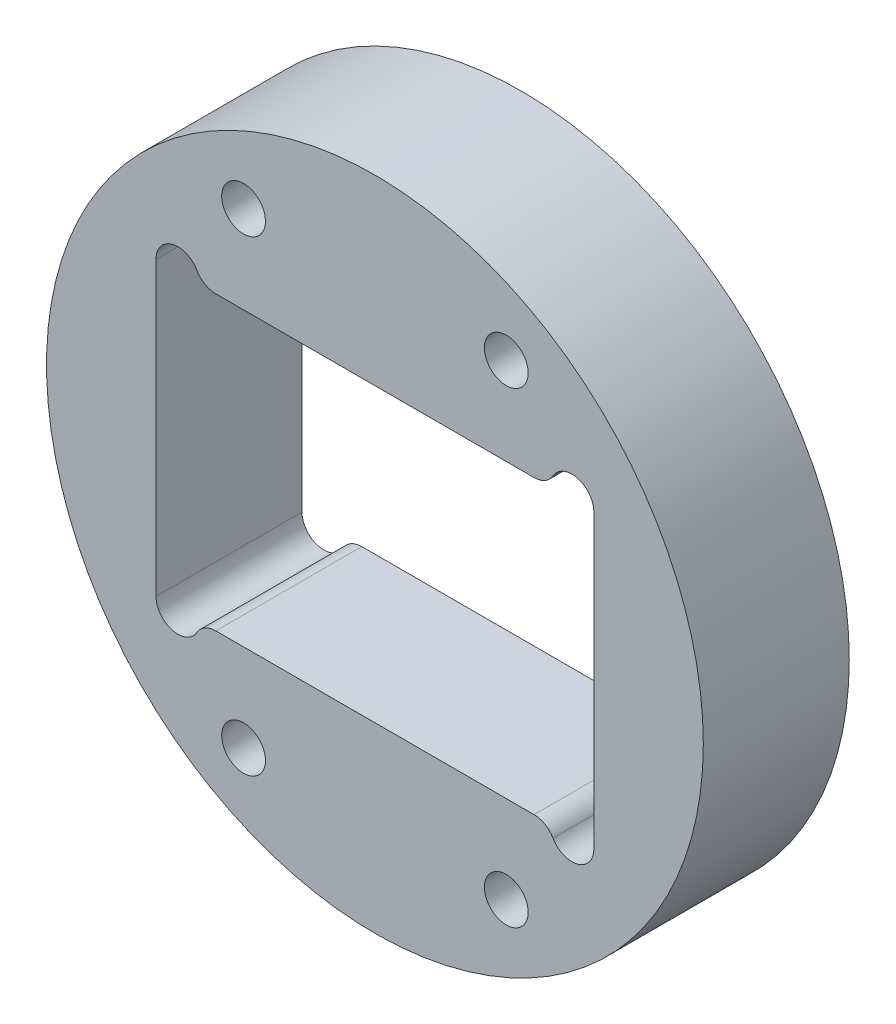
ISO-10303-21;
HEADER;
FILE_DESCRIPTION(('STEP AP214'),'2;1');
FILE_NAME('part.step','',(''),(''),'','','');
FILE_SCHEMA(('AUTOMOTIVE_DESIGN { 1 0 10303 214 1 1 1 1 }'));
ENDSEC;
DATA;
#1=APPLICATION_CONTEXT('core data for automotive mechanical design processes');
#2=APPLICATION_PROTOCOL_DEFINITION('international standard','automotive_design',2000,#1);
#3=PRODUCT_CONTEXT('',#1,'mechanical');
#4=PRODUCT('Part','Part','',(#3));
#5=PRODUCT_RELATED_PRODUCT_CATEGORY('part','',(#4));
#6=PRODUCT_DEFINITION_FORMATION('','',#4);
#7=PRODUCT_DEFINITION_CONTEXT('part definition',#1,'design');
#8=PRODUCT_DEFINITION('design','',#6,#7);
#9=PRODUCT_DEFINITION_SHAPE('','',#8);
#10=(LENGTH_UNIT() NAMED_UNIT(*) SI_UNIT(.MILLI.,.METRE.));
#11=(NAMED_UNIT(*) PLANE_ANGLE_UNIT() SI_UNIT($,.RADIAN.));
#12=(NAMED_UNIT(*) SI_UNIT($,.STERADIAN.) SOLID_ANGLE_UNIT());
#13=UNCERTAINTY_MEASURE_WITH_UNIT(LENGTH_MEASURE(1.E-05),#10,'distance_accuracy_value','');
#14=(GEOMETRIC_REPRESENTATION_CONTEXT(3) GLOBAL_UNCERTAINTY_ASSIGNED_CONTEXT((#13)) GLOBAL_UNIT_ASSIGNED_CONTEXT((#10,
#11,#12)) REPRESENTATION_CONTEXT('',''));
#15=CARTESIAN_POINT('',(0.,0.,0.));
#16=DIRECTION('',(0.,0.,1.));
#17=DIRECTION('',(1.,0.,0.));
#18=AXIS2_PLACEMENT_3D('',#15,#16,#17);
#19=CARTESIAN_POINT('',(-62.0464763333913,20.0201457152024,10.));
#20=DIRECTION('',(0.,0.,1.));
#21=DIRECTION('',(1.,0.,0.));
#22=AXIS2_PLACEMENT_3D('',#19,#20,#21);
#23=PLANE('',#22);
#24=CARTESIAN_POINT('',(-53.0464763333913,4.02014571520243,10.));
#25=DIRECTION('',(0.,0.,1.));
#26=DIRECTION('',(1.,0.,0.));
#27=AXIS2_PLACEMENT_3D('',#24,#25,#26);
#28=CIRCLE('',#27,1.5);
#29=CARTESIAN_POINT('',(-51.5464763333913,4.02014571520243,10.));
#30=VERTEX_POINT('',#29);
#31=EDGE_CURVE('E425',#30,#30,#28,.T.);
#32=ORIENTED_EDGE('',*,*,#31,.F.);
#33=EDGE_LOOP('',(#32));
#34=FACE_BOUND('',#33,.T.);
#35=CARTESIAN_POINT('',(-71.0464763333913,36.0201457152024,10.));
#36=DIRECTION('',(0.,0.,1.));
#37=DIRECTION('',(1.,0.,0.));
#38=AXIS2_PLACEMENT_3D('',#35,#36,#37);
#39=CIRCLE('',#38,1.5);
#40=CARTESIAN_POINT('',(-69.5464763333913,36.0201457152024,10.));
#41=VERTEX_POINT('',#40);
#42=EDGE_CURVE('E177',#41,#41,#39,.T.);
#43=ORIENTED_EDGE('',*,*,#42,.F.);
#44=EDGE_LOOP('',(#43));
#45=FACE_BOUND('',#44,.T.);
#46=CARTESIAN_POINT('',(-62.0464763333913,20.0201457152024,10.));
#47=DIRECTION('',(0.,0.,1.));
#48=DIRECTION('',(1.,0.,0.));
#49=AXIS2_PLACEMENT_3D('',#46,#47,#48);
#50=CIRCLE('',#49,22.5);
#51=CARTESIAN_POINT('',(-39.5464763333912,20.0201457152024,10.));
#52=VERTEX_POINT('',#51);
#53=EDGE_CURVE('E11',#52,#52,#50,.T.);
#54=ORIENTED_EDGE('',*,*,#53,.T.);
#55=EDGE_LOOP('',(#54));
#56=FACE_BOUND('',#55,.T.);
#57=DIRECTION('',(-1.,0.,0.));
#58=VECTOR('',#57,1.);
#59=CARTESIAN_POINT('',(-72.948400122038,30.0201457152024,10.));
#60=LINE('',#59,#58);
#61=CARTESIAN_POINT('',(-51.1445525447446,30.0201457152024,10.));
#62=VERTEX_POINT('',#61);
#63=CARTESIAN_POINT('',(-72.948400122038,30.0201457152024,10.));
#64=VERTEX_POINT('',#63);
#65=EDGE_CURVE('E140',#62,#64,#60,.T.);
#66=ORIENTED_EDGE('',*,*,#65,.F.);
#67=CARTESIAN_POINT('',(-51.1445525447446,31.5201457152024,10.));
#68=DIRECTION('',(0.,0.,-1.));
#69=DIRECTION('',(1.,0.,0.));
#70=AXIS2_PLACEMENT_3D('',#67,#68,#69);
#71=CIRCLE('',#70,1.5);
#72=CARTESIAN_POINT('',(-49.8455144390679,30.7701457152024,10.));
#73=VERTEX_POINT('',#72);
#74=EDGE_CURVE('E132',#73,#62,#71,.T.);
#75=ORIENTED_EDGE('',*,*,#74,.F.);
#76=CARTESIAN_POINT('',(-48.5464763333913,30.0201457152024,10.));
#77=DIRECTION('',(0.,0.,1.));
#78=DIRECTION('',(1.,0.,0.));
#79=AXIS2_PLACEMENT_3D('',#76,#77,#78);
#80=CIRCLE('',#79,1.5);
#81=CARTESIAN_POINT('',(-47.0464763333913,30.0201457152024,10.));
#82=VERTEX_POINT('',#81);
#83=EDGE_CURVE('E174',#82,#73,#80,.T.);
#84=ORIENTED_EDGE('',*,*,#83,.F.);
#85=DIRECTION('',(0.,1.,0.));
#86=VECTOR('',#85,1.);
#87=CARTESIAN_POINT('',(-47.0464763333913,30.0201457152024,10.));
#88=LINE('',#87,#86);
#89=CARTESIAN_POINT('',(-47.0464763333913,10.0201457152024,10.));
#90=VERTEX_POINT('',#89);
#91=EDGE_CURVE('E172',#90,#82,#88,.T.);
#92=ORIENTED_EDGE('',*,*,#91,.F.);
#93=CARTESIAN_POINT('',(-48.5464763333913,10.0201457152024,10.));
#94=DIRECTION('',(0.,0.,1.));
#95=DIRECTION('',(1.,0.,0.));
#96=AXIS2_PLACEMENT_3D('',#93,#94,#95);
#97=CIRCLE('',#96,1.5);
#98=CARTESIAN_POINT('',(-49.8455144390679,9.27014571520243,10.));
#99=VERTEX_POINT('',#98);
#100=EDGE_CURVE('E170',#99,#90,#97,.T.);
#101=ORIENTED_EDGE('',*,*,#100,.F.);
#102=CARTESIAN_POINT('',(-51.1445525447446,8.52014571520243,10.));
#103=DIRECTION('',(0.,0.,-1.));
#104=DIRECTION('',(1.,0.,0.));
#105=AXIS2_PLACEMENT_3D('',#102,#103,#104);
#106=CIRCLE('',#105,1.5);
#107=CARTESIAN_POINT('',(-51.1445525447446,10.0201457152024,10.));
#108=VERTEX_POINT('',#107);
#109=EDGE_CURVE('E168',#108,#99,#106,.T.);
#110=ORIENTED_EDGE('',*,*,#109,.F.);
#111=DIRECTION('',(1.,0.,0.));
#112=VECTOR('',#111,1.);
#113=CARTESIAN_POINT('',(-51.1445525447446,10.0201457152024,10.));
#114=LINE('',#113,#112);
#115=CARTESIAN_POINT('',(-72.948400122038,10.0201457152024,10.));
#116=VERTEX_POINT('',#115);
#117=EDGE_CURVE('E166',#116,#108,#114,.T.);
#118=ORIENTED_EDGE('',*,*,#117,.F.);
#119=CARTESIAN_POINT('',(-72.948400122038,8.52014571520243,10.));
#120=DIRECTION('',(0.,0.,-1.));
#121=DIRECTION('',(1.,0.,0.));
#122=AXIS2_PLACEMENT_3D('',#119,#120,#121);
#123=CIRCLE('',#122,1.5);
#124=CARTESIAN_POINT('',(-74.2474382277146,9.27014571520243,10.));
#125=VERTEX_POINT('',#124);
#126=EDGE_CURVE('E164',#125,#116,#123,.T.);
#127=ORIENTED_EDGE('',*,*,#126,.F.);
#128=CARTESIAN_POINT('',(-75.5464763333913,10.0201457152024,10.));
#129=DIRECTION('',(0.,0.,1.));
#130=DIRECTION('',(1.,0.,0.));
#131=AXIS2_PLACEMENT_3D('',#128,#129,#130);
#132=CIRCLE('',#131,1.5);
#133=CARTESIAN_POINT('',(-77.0464763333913,10.0201457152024,10.));
#134=VERTEX_POINT('',#133);
#135=EDGE_CURVE('E162',#134,#125,#132,.T.);
#136=ORIENTED_EDGE('',*,*,#135,.F.);
#137=DIRECTION('',(0.,-1.,0.));
#138=VECTOR('',#137,1.);
#139=CARTESIAN_POINT('',(-77.0464763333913,10.0201457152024,10.));
#140=LINE('',#139,#138);
#141=CARTESIAN_POINT('',(-77.0464763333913,30.0201457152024,10.));
#142=VERTEX_POINT('',#141);
#143=EDGE_CURVE('E160',#142,#134,#140,.T.);
#144=ORIENTED_EDGE('',*,*,#143,.F.);
#145=CARTESIAN_POINT('',(-75.5464763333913,30.0201457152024,10.));
#146=DIRECTION('',(0.,0.,1.));
#147=DIRECTION('',(1.,0.,0.));
#148=AXIS2_PLACEMENT_3D('',#145,#146,#147);
#149=CIRCLE('',#148,1.5);
#150=CARTESIAN_POINT('',(-74.2474382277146,30.7701457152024,10.));
#151=VERTEX_POINT('',#150);
#152=EDGE_CURVE('E155',#151,#142,#149,.T.);
#153=ORIENTED_EDGE('',*,*,#152,.F.);
#154=CARTESIAN_POINT('',(-72.948400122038,31.5201457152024,10.));
#155=DIRECTION('',(0.,0.,-1.));
#156=DIRECTION('',(1.,0.,0.));
#157=AXIS2_PLACEMENT_3D('',#154,#155,#156);
#158=CIRCLE('',#157,1.5);
#159=EDGE_CURVE('E153',#64,#151,#158,.T.);
#160=ORIENTED_EDGE('',*,*,#159,.F.);
#161=EDGE_LOOP('',(#66,#75,#84,#92,#101,#110,#118,#127,#136,#144,#153,#160));
#162=FACE_BOUND('',#161,.T.);
#163=CARTESIAN_POINT('',(-53.0464763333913,36.0201457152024,10.));
#164=DIRECTION('',(0.,0.,1.));
#165=DIRECTION('',(1.,0.,0.));
#166=AXIS2_PLACEMENT_3D('',#163,#164,#165);
#167=CIRCLE('',#166,1.5);
#168=CARTESIAN_POINT('',(-51.5464763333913,36.0201457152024,10.));
#169=VERTEX_POINT('',#168);
#170=EDGE_CURVE('E431',#169,#169,#167,.T.);
#171=ORIENTED_EDGE('',*,*,#170,.F.);
#172=EDGE_LOOP('',(#171));
#173=FACE_BOUND('',#172,.T.);
#174=CARTESIAN_POINT('',(-71.0464763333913,4.02014571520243,10.));
#175=DIRECTION('',(0.,0.,1.));
#176=DIRECTION('',(1.,0.,0.));
#177=AXIS2_PLACEMENT_3D('',#174,#175,#176);
#178=CIRCLE('',#177,1.5);
#179=CARTESIAN_POINT('',(-69.5464763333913,4.02014571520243,10.));
#180=VERTEX_POINT('',#179);
#181=EDGE_CURVE('E416',#180,#180,#178,.T.);
#182=ORIENTED_EDGE('',*,*,#181,.F.);
#183=EDGE_LOOP('',(#182));
#184=FACE_BOUND('',#183,.T.);
#185=ADVANCED_FACE('F43',(#34,#45,#56,#162,#173,#184),#23,.T.);
#186=CARTESIAN_POINT('',(-62.0464763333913,20.0201457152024,0.));
#187=DIRECTION('',(0.,0.,1.));
#188=DIRECTION('',(1.,0.,0.));
#189=AXIS2_PLACEMENT_3D('',#186,#187,#188);
#190=PLANE('',#189);
#191=CARTESIAN_POINT('',(-62.0464763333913,20.0201457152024,0.));
#192=DIRECTION('',(0.,0.,1.));
#193=DIRECTION('',(1.,0.,0.));
#194=AXIS2_PLACEMENT_3D('',#191,#192,#193);
#195=CIRCLE('',#194,22.5);
#196=CARTESIAN_POINT('',(-39.5464763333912,20.0201457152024,0.));
#197=VERTEX_POINT('',#196);
#198=EDGE_CURVE('E47',#197,#197,#195,.T.);
#199=ORIENTED_EDGE('',*,*,#198,.F.);
#200=EDGE_LOOP('',(#199));
#201=FACE_BOUND('',#200,.T.);
#202=CARTESIAN_POINT('',(-51.1445525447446,31.5201457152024,0.));
#203=DIRECTION('',(0.,0.,-1.));
#204=DIRECTION('',(1.,0.,0.));
#205=AXIS2_PLACEMENT_3D('',#202,#203,#204);
#206=CIRCLE('',#205,1.5);
#207=CARTESIAN_POINT('',(-49.8455144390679,30.7701457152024,0.));
#208=VERTEX_POINT('',#207);
#209=CARTESIAN_POINT('',(-51.1445525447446,30.0201457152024,0.));
#210=VERTEX_POINT('',#209);
#211=EDGE_CURVE('E66',#208,#210,#206,.T.);
#212=ORIENTED_EDGE('',*,*,#211,.T.);
#213=DIRECTION('',(-1.,0.,0.));
#214=VECTOR('',#213,1.);
#215=CARTESIAN_POINT('',(-72.948400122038,30.0201457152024,0.));
#216=LINE('',#215,#214);
#217=CARTESIAN_POINT('',(-72.948400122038,30.0201457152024,0.));
#218=VERTEX_POINT('',#217);
#219=EDGE_CURVE('E147',#210,#218,#216,.T.);
#220=ORIENTED_EDGE('',*,*,#219,.T.);
#221=CARTESIAN_POINT('',(-72.948400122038,31.5201457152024,0.));
#222=DIRECTION('',(0.,0.,-1.));
#223=DIRECTION('',(1.,0.,0.));
#224=AXIS2_PLACEMENT_3D('',#221,#222,#223);
#225=CIRCLE('',#224,1.5);
#226=CARTESIAN_POINT('',(-74.2474382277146,30.7701457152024,0.));
#227=VERTEX_POINT('',#226);
#228=EDGE_CURVE('E179',#218,#227,#225,.T.);
#229=ORIENTED_EDGE('',*,*,#228,.T.);
#230=CARTESIAN_POINT('',(-75.5464763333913,30.0201457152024,0.));
#231=DIRECTION('',(0.,0.,1.));
#232=DIRECTION('',(1.,0.,0.));
#233=AXIS2_PLACEMENT_3D('',#230,#231,#232);
#234=CIRCLE('',#233,1.5);
#235=CARTESIAN_POINT('',(-77.0464763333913,30.0201457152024,0.));
#236=VERTEX_POINT('',#235);
#237=EDGE_CURVE('E182',#227,#236,#234,.T.);
#238=ORIENTED_EDGE('',*,*,#237,.T.);
#239=DIRECTION('',(0.,-1.,0.));
#240=VECTOR('',#239,1.);
#241=CARTESIAN_POINT('',(-77.0464763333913,10.0201457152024,0.));
#242=LINE('',#241,#240);
#243=CARTESIAN_POINT('',(-77.0464763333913,10.0201457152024,0.));
#244=VERTEX_POINT('',#243);
#245=EDGE_CURVE('E185',#236,#244,#242,.T.);
#246=ORIENTED_EDGE('',*,*,#245,.T.);
#247=CARTESIAN_POINT('',(-75.5464763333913,10.0201457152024,0.));
#248=DIRECTION('',(0.,0.,1.));
#249=DIRECTION('',(1.,0.,0.));
#250=AXIS2_PLACEMENT_3D('',#247,#248,#249);
#251=CIRCLE('',#250,1.5);
#252=CARTESIAN_POINT('',(-74.2474382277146,9.27014571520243,0.));
#253=VERTEX_POINT('',#252);
#254=EDGE_CURVE('E188',#244,#253,#251,.T.);
#255=ORIENTED_EDGE('',*,*,#254,.T.);
#256=CARTESIAN_POINT('',(-72.948400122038,8.52014571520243,0.));
#257=DIRECTION('',(0.,0.,-1.));
#258=DIRECTION('',(1.,0.,0.));
#259=AXIS2_PLACEMENT_3D('',#256,#257,#258);
#260=CIRCLE('',#259,1.5);
#261=CARTESIAN_POINT('',(-72.948400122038,10.0201457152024,0.));
#262=VERTEX_POINT('',#261);
#263=EDGE_CURVE('E191',#253,#262,#260,.T.);
#264=ORIENTED_EDGE('',*,*,#263,.T.);
#265=DIRECTION('',(1.,0.,0.));
#266=VECTOR('',#265,1.);
#267=CARTESIAN_POINT('',(-51.1445525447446,10.0201457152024,0.));
#268=LINE('',#267,#266);
#269=CARTESIAN_POINT('',(-51.1445525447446,10.0201457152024,0.));
#270=VERTEX_POINT('',#269);
#271=EDGE_CURVE('E194',#262,#270,#268,.T.);
#272=ORIENTED_EDGE('',*,*,#271,.T.);
#273=CARTESIAN_POINT('',(-51.1445525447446,8.52014571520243,0.));
#274=DIRECTION('',(0.,0.,-1.));
#275=DIRECTION('',(1.,0.,0.));
#276=AXIS2_PLACEMENT_3D('',#273,#274,#275);
#277=CIRCLE('',#276,1.5);
#278=CARTESIAN_POINT('',(-49.8455144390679,9.27014571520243,0.));
#279=VERTEX_POINT('',#278);
#280=EDGE_CURVE('E197',#270,#279,#277,.T.);
#281=ORIENTED_EDGE('',*,*,#280,.T.);
#282=CARTESIAN_POINT('',(-48.5464763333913,10.0201457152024,0.));
#283=DIRECTION('',(0.,0.,1.));
#284=DIRECTION('',(1.,0.,0.));
#285=AXIS2_PLACEMENT_3D('',#282,#283,#284);
#286=CIRCLE('',#285,1.5);
#287=CARTESIAN_POINT('',(-47.0464763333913,10.0201457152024,0.));
#288=VERTEX_POINT('',#287);
#289=EDGE_CURVE('E200',#279,#288,#286,.T.);
#290=ORIENTED_EDGE('',*,*,#289,.T.);
#291=DIRECTION('',(0.,1.,0.));
#292=VECTOR('',#291,1.);
#293=CARTESIAN_POINT('',(-47.0464763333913,30.0201457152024,0.));
#294=LINE('',#293,#292);
#295=CARTESIAN_POINT('',(-47.0464763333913,30.0201457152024,0.));
#296=VERTEX_POINT('',#295);
#297=EDGE_CURVE('E203',#288,#296,#294,.T.);
#298=ORIENTED_EDGE('',*,*,#297,.T.);
#299=CARTESIAN_POINT('',(-48.5464763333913,30.0201457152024,0.));
#300=DIRECTION('',(0.,0.,1.));
#301=DIRECTION('',(1.,0.,0.));
#302=AXIS2_PLACEMENT_3D('',#299,#300,#301);
#303=CIRCLE('',#302,1.5);
#304=EDGE_CURVE('E141',#296,#208,#303,.T.);
#305=ORIENTED_EDGE('',*,*,#304,.T.);
#306=EDGE_LOOP('',(#212,#220,#229,#238,#246,#255,#264,#272,#281,#290,#298,#305));
#307=FACE_BOUND('',#306,.T.);
#308=CARTESIAN_POINT('',(-71.0464763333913,36.0201457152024,0.));
#309=DIRECTION('',(0.,0.,1.));
#310=DIRECTION('',(1.,0.,0.));
#311=AXIS2_PLACEMENT_3D('',#308,#309,#310);
#312=CIRCLE('',#311,1.5);
#313=CARTESIAN_POINT('',(-69.5464763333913,36.0201457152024,0.));
#314=VERTEX_POINT('',#313);
#315=EDGE_CURVE('E434',#314,#314,#312,.T.);
#316=ORIENTED_EDGE('',*,*,#315,.T.);
#317=EDGE_LOOP('',(#316));
#318=FACE_BOUND('',#317,.T.);
#319=CARTESIAN_POINT('',(-53.0464763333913,36.0201457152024,0.));
#320=DIRECTION('',(0.,0.,1.));
#321=DIRECTION('',(1.,0.,0.));
#322=AXIS2_PLACEMENT_3D('',#319,#320,#321);
#323=CIRCLE('',#322,1.5);
#324=CARTESIAN_POINT('',(-51.5464763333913,36.0201457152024,0.));
#325=VERTEX_POINT('',#324);
#326=EDGE_CURVE('E428',#325,#325,#323,.T.);
#327=ORIENTED_EDGE('',*,*,#326,.T.);
#328=EDGE_LOOP('',(#327));
#329=FACE_BOUND('',#328,.T.);
#330=CARTESIAN_POINT('',(-53.0464763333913,4.02014571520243,0.));
#331=DIRECTION('',(0.,0.,1.));
#332=DIRECTION('',(1.,0.,0.));
#333=AXIS2_PLACEMENT_3D('',#330,#331,#332);
#334=CIRCLE('',#333,1.5);
#335=CARTESIAN_POINT('',(-51.5464763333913,4.02014571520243,0.));
#336=VERTEX_POINT('',#335);
#337=EDGE_CURVE('E422',#336,#336,#334,.T.);
#338=ORIENTED_EDGE('',*,*,#337,.T.);
#339=EDGE_LOOP('',(#338));
#340=FACE_BOUND('',#339,.T.);
#341=CARTESIAN_POINT('',(-71.0464763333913,4.02014571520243,0.));
#342=DIRECTION('',(0.,0.,1.));
#343=DIRECTION('',(1.,0.,0.));
#344=AXIS2_PLACEMENT_3D('',#341,#342,#343);
#345=CIRCLE('',#344,1.5);
#346=CARTESIAN_POINT('',(-69.5464763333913,4.02014571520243,0.));
#347=VERTEX_POINT('',#346);
#348=EDGE_CURVE('E419',#347,#347,#345,.T.);
#349=ORIENTED_EDGE('',*,*,#348,.T.);
#350=EDGE_LOOP('',(#349));
#351=FACE_BOUND('',#350,.T.);
#352=ADVANCED_FACE('F232',(#201,#307,#318,#329,#340,#351),#190,.F.);
#353=CARTESIAN_POINT('',(-62.0464763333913,20.0201457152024,10.));
#354=DIRECTION('',(0.,0.,-1.));
#355=DIRECTION('',(-1.,0.,0.));
#356=AXIS2_PLACEMENT_3D('',#353,#354,#355);
#357=CYLINDRICAL_SURFACE('',#356,22.5);
#358=ORIENTED_EDGE('',*,*,#53,.F.);
#359=EDGE_LOOP('',(#358));
#360=FACE_BOUND('',#359,.T.);
#361=ORIENTED_EDGE('',*,*,#198,.T.);
#362=EDGE_LOOP('',(#361));
#363=FACE_BOUND('',#362,.T.);
#364=ADVANCED_FACE('F45',(#360,#363),#357,.T.);
#365=CARTESIAN_POINT('',(-51.1445525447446,31.5201457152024,10.));
#366=DIRECTION('',(0.,0.,-1.));
#367=DIRECTION('',(-1.,0.,0.));
#368=AXIS2_PLACEMENT_3D('',#365,#366,#367);
#369=CYLINDRICAL_SURFACE('',#368,1.5);
#370=ORIENTED_EDGE('',*,*,#211,.F.);
#371=DIRECTION('',(0.,0.,-1.));
#372=VECTOR('',#371,1.);
#373=CARTESIAN_POINT('',(-49.8455144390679,30.7701457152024,10.));
#374=LINE('',#373,#372);
#375=EDGE_CURVE('E136',#73,#208,#374,.T.);
#376=ORIENTED_EDGE('',*,*,#375,.F.);
#377=ORIENTED_EDGE('',*,*,#74,.T.);
#378=DIRECTION('',(0.,0.,-1.));
#379=VECTOR('',#378,1.);
#380=CARTESIAN_POINT('',(-51.1445525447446,30.0201457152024,10.));
#381=LINE('',#380,#379);
#382=EDGE_CURVE('E135',#62,#210,#381,.T.);
#383=ORIENTED_EDGE('',*,*,#382,.T.);
#384=EDGE_LOOP('',(#370,#376,#377,#383));
#385=FACE_BOUND('',#384,.T.);
#386=ADVANCED_FACE('F134',(#385),#369,.T.);
#387=CARTESIAN_POINT('',(-72.948400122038,30.0201457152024,10.));
#388=DIRECTION('',(0.,-1.,0.));
#389=DIRECTION('',(0.,0.,-1.));
#390=AXIS2_PLACEMENT_3D('',#387,#388,#389);
#391=PLANE('',#390);
#392=ORIENTED_EDGE('',*,*,#219,.F.);
#393=ORIENTED_EDGE('',*,*,#382,.F.);
#394=ORIENTED_EDGE('',*,*,#65,.T.);
#395=DIRECTION('',(0.,0.,-1.));
#396=VECTOR('',#395,1.);
#397=CARTESIAN_POINT('',(-72.948400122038,30.0201457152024,10.));
#398=LINE('',#397,#396);
#399=EDGE_CURVE('E148',#64,#218,#398,.T.);
#400=ORIENTED_EDGE('',*,*,#399,.T.);
#401=EDGE_LOOP('',(#392,#393,#394,#400));
#402=FACE_BOUND('',#401,.T.);
#403=ADVANCED_FACE('F144',(#402),#391,.T.);
#404=CARTESIAN_POINT('',(-72.948400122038,31.5201457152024,10.));
#405=DIRECTION('',(0.,0.,-1.));
#406=DIRECTION('',(-1.,0.,0.));
#407=AXIS2_PLACEMENT_3D('',#404,#405,#406);
#408=CYLINDRICAL_SURFACE('',#407,1.5);
#409=ORIENTED_EDGE('',*,*,#228,.F.);
#410=ORIENTED_EDGE('',*,*,#399,.F.);
#411=ORIENTED_EDGE('',*,*,#159,.T.);
#412=DIRECTION('',(0.,0.,-1.));
#413=VECTOR('',#412,1.);
#414=CARTESIAN_POINT('',(-74.2474382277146,30.7701457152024,10.));
#415=LINE('',#414,#413);
#416=EDGE_CURVE('E224',#151,#227,#415,.T.);
#417=ORIENTED_EDGE('',*,*,#416,.T.);
#418=EDGE_LOOP('',(#409,#410,#411,#417));
#419=FACE_BOUND('',#418,.T.);
#420=ADVANCED_FACE('F228',(#419),#408,.T.);
#421=CARTESIAN_POINT('',(-75.5464763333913,30.0201457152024,10.));
#422=DIRECTION('',(0.,0.,-1.));
#423=DIRECTION('',(-1.,0.,0.));
#424=AXIS2_PLACEMENT_3D('',#421,#422,#423);
#425=CYLINDRICAL_SURFACE('',#424,1.5);
#426=ORIENTED_EDGE('',*,*,#237,.F.);
#427=ORIENTED_EDGE('',*,*,#416,.F.);
#428=ORIENTED_EDGE('',*,*,#152,.T.);
#429=DIRECTION('',(0.,0.,-1.));
#430=VECTOR('',#429,1.);
#431=CARTESIAN_POINT('',(-77.0464763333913,30.0201457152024,10.));
#432=LINE('',#431,#430);
#433=EDGE_CURVE('E222',#142,#236,#432,.T.);
#434=ORIENTED_EDGE('',*,*,#433,.T.);
#435=EDGE_LOOP('',(#426,#427,#428,#434));
#436=FACE_BOUND('',#435,.T.);
#437=ADVANCED_FACE('F271',(#436),#425,.F.);
#438=CARTESIAN_POINT('',(-77.0464763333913,10.0201457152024,10.));
#439=DIRECTION('',(1.,0.,0.));
#440=DIRECTION('',(0.,1.,0.));
#441=AXIS2_PLACEMENT_3D('',#438,#439,#440);
#442=PLANE('',#441);
#443=ORIENTED_EDGE('',*,*,#245,.F.);
#444=ORIENTED_EDGE('',*,*,#433,.F.);
#445=ORIENTED_EDGE('',*,*,#143,.T.);
#446=DIRECTION('',(0.,0.,-1.));
#447=VECTOR('',#446,1.);
#448=CARTESIAN_POINT('',(-77.0464763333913,10.0201457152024,10.));
#449=LINE('',#448,#447);
#450=EDGE_CURVE('E220',#134,#244,#449,.T.);
#451=ORIENTED_EDGE('',*,*,#450,.T.);
#452=EDGE_LOOP('',(#443,#444,#445,#451));
#453=FACE_BOUND('',#452,.T.);
#454=ADVANCED_FACE('F269',(#453),#442,.T.);
#455=CARTESIAN_POINT('',(-75.5464763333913,10.0201457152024,10.));
#456=DIRECTION('',(0.,0.,-1.));
#457=DIRECTION('',(-1.,0.,0.));
#458=AXIS2_PLACEMENT_3D('',#455,#456,#457);
#459=CYLINDRICAL_SURFACE('',#458,1.5);
#460=ORIENTED_EDGE('',*,*,#254,.F.);
#461=ORIENTED_EDGE('',*,*,#450,.F.);
#462=ORIENTED_EDGE('',*,*,#135,.T.);
#463=DIRECTION('',(0.,0.,-1.));
#464=VECTOR('',#463,1.);
#465=CARTESIAN_POINT('',(-74.2474382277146,9.27014571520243,10.));
#466=LINE('',#465,#464);
#467=EDGE_CURVE('E218',#125,#253,#466,.T.);
#468=ORIENTED_EDGE('',*,*,#467,.T.);
#469=EDGE_LOOP('',(#460,#461,#462,#468));
#470=FACE_BOUND('',#469,.T.);
#471=ADVANCED_FACE('F263',(#470),#459,.F.);
#472=CARTESIAN_POINT('',(-72.948400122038,8.52014571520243,10.));
#473=DIRECTION('',(0.,0.,-1.));
#474=DIRECTION('',(-1.,0.,0.));
#475=AXIS2_PLACEMENT_3D('',#472,#473,#474);
#476=CYLINDRICAL_SURFACE('',#475,1.5);
#477=ORIENTED_EDGE('',*,*,#263,.F.);
#478=ORIENTED_EDGE('',*,*,#467,.F.);
#479=ORIENTED_EDGE('',*,*,#126,.T.);
#480=DIRECTION('',(0.,0.,-1.));
#481=VECTOR('',#480,1.);
#482=CARTESIAN_POINT('',(-72.948400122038,10.0201457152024,10.));
#483=LINE('',#482,#481);
#484=EDGE_CURVE('E216',#116,#262,#483,.T.);
#485=ORIENTED_EDGE('',*,*,#484,.T.);
#486=EDGE_LOOP('',(#477,#478,#479,#485));
#487=FACE_BOUND('',#486,.T.);
#488=ADVANCED_FACE('F259',(#487),#476,.T.);
#489=CARTESIAN_POINT('',(-51.1445525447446,10.0201457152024,10.));
#490=DIRECTION('',(0.,1.,0.));
#491=DIRECTION('',(-1.,0.,0.));
#492=AXIS2_PLACEMENT_3D('',#489,#490,#491);
#493=PLANE('',#492);
#494=ORIENTED_EDGE('',*,*,#271,.F.);
#495=ORIENTED_EDGE('',*,*,#484,.F.);
#496=ORIENTED_EDGE('',*,*,#117,.T.);
#497=DIRECTION('',(0.,0.,-1.));
#498=VECTOR('',#497,1.);
#499=CARTESIAN_POINT('',(-51.1445525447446,10.0201457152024,10.));
#500=LINE('',#499,#498);
#501=EDGE_CURVE('E214',#108,#270,#500,.T.);
#502=ORIENTED_EDGE('',*,*,#501,.T.);
#503=EDGE_LOOP('',(#494,#495,#496,#502));
#504=FACE_BOUND('',#503,.T.);
#505=ADVANCED_FACE('F256',(#504),#493,.T.);
#506=CARTESIAN_POINT('',(-51.1445525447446,8.52014571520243,10.));
#507=DIRECTION('',(0.,0.,-1.));
#508=DIRECTION('',(-1.,0.,0.));
#509=AXIS2_PLACEMENT_3D('',#506,#507,#508);
#510=CYLINDRICAL_SURFACE('',#509,1.5);
#511=ORIENTED_EDGE('',*,*,#280,.F.);
#512=ORIENTED_EDGE('',*,*,#501,.F.);
#513=ORIENTED_EDGE('',*,*,#109,.T.);
#514=DIRECTION('',(0.,0.,-1.));
#515=VECTOR('',#514,1.);
#516=CARTESIAN_POINT('',(-49.8455144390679,9.27014571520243,10.));
#517=LINE('',#516,#515);
#518=EDGE_CURVE('E212',#99,#279,#517,.T.);
#519=ORIENTED_EDGE('',*,*,#518,.T.);
#520=EDGE_LOOP('',(#511,#512,#513,#519));
#521=FACE_BOUND('',#520,.T.);
#522=ADVANCED_FACE('F248',(#521),#510,.T.);
#523=CARTESIAN_POINT('',(-48.5464763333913,10.0201457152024,10.));
#524=DIRECTION('',(0.,0.,-1.));
#525=DIRECTION('',(-1.,0.,0.));
#526=AXIS2_PLACEMENT_3D('',#523,#524,#525);
#527=CYLINDRICAL_SURFACE('',#526,1.5);
#528=ORIENTED_EDGE('',*,*,#289,.F.);
#529=ORIENTED_EDGE('',*,*,#518,.F.);
#530=ORIENTED_EDGE('',*,*,#100,.T.);
#531=DIRECTION('',(0.,0.,-1.));
#532=VECTOR('',#531,1.);
#533=CARTESIAN_POINT('',(-47.0464763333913,10.0201457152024,10.));
#534=LINE('',#533,#532);
#535=EDGE_CURVE('E210',#90,#288,#534,.T.);
#536=ORIENTED_EDGE('',*,*,#535,.T.);
#537=EDGE_LOOP('',(#528,#529,#530,#536));
#538=FACE_BOUND('',#537,.T.);
#539=ADVANCED_FACE('F244',(#538),#527,.F.);
#540=CARTESIAN_POINT('',(-47.0464763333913,30.0201457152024,10.));
#541=DIRECTION('',(-1.,0.,0.));
#542=DIRECTION('',(0.,-1.,0.));
#543=AXIS2_PLACEMENT_3D('',#540,#541,#542);
#544=PLANE('',#543);
#545=ORIENTED_EDGE('',*,*,#297,.F.);
#546=ORIENTED_EDGE('',*,*,#535,.F.);
#547=ORIENTED_EDGE('',*,*,#91,.T.);
#548=DIRECTION('',(0.,0.,-1.));
#549=VECTOR('',#548,1.);
#550=CARTESIAN_POINT('',(-47.0464763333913,30.0201457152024,10.));
#551=LINE('',#550,#549);
#552=EDGE_CURVE('E58',#82,#296,#551,.T.);
#553=ORIENTED_EDGE('',*,*,#552,.T.);
#554=EDGE_LOOP('',(#545,#546,#547,#553));
#555=FACE_BOUND('',#554,.T.);
#556=ADVANCED_FACE('F241',(#555),#544,.T.);
#557=CARTESIAN_POINT('',(-48.5464763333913,30.0201457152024,10.));
#558=DIRECTION('',(0.,0.,-1.));
#559=DIRECTION('',(-1.,0.,0.));
#560=AXIS2_PLACEMENT_3D('',#557,#558,#559);
#561=CYLINDRICAL_SURFACE('',#560,1.5);
#562=ORIENTED_EDGE('',*,*,#304,.F.);
#563=ORIENTED_EDGE('',*,*,#552,.F.);
#564=ORIENTED_EDGE('',*,*,#83,.T.);
#565=ORIENTED_EDGE('',*,*,#375,.T.);
#566=EDGE_LOOP('',(#562,#563,#564,#565));
#567=FACE_BOUND('',#566,.T.);
#568=ADVANCED_FACE('F235',(#567),#561,.F.);
#569=CARTESIAN_POINT('',(-71.0464763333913,36.0201457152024,10.));
#570=DIRECTION('',(0.,0.,-1.));
#571=DIRECTION('',(-1.,0.,0.));
#572=AXIS2_PLACEMENT_3D('',#569,#570,#571);
#573=CYLINDRICAL_SURFACE('',#572,1.5);
#574=ORIENTED_EDGE('',*,*,#42,.T.);
#575=EDGE_LOOP('',(#574));
#576=FACE_BOUND('',#575,.T.);
#577=ORIENTED_EDGE('',*,*,#315,.F.);
#578=EDGE_LOOP('',(#577));
#579=FACE_BOUND('',#578,.T.);
#580=ADVANCED_FACE('F371',(#576,#579),#573,.F.);
#581=CARTESIAN_POINT('',(-53.0464763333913,36.0201457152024,10.));
#582=DIRECTION('',(0.,0.,-1.));
#583=DIRECTION('',(-1.,0.,0.));
#584=AXIS2_PLACEMENT_3D('',#581,#582,#583);
#585=CYLINDRICAL_SURFACE('',#584,1.5);
#586=ORIENTED_EDGE('',*,*,#170,.T.);
#587=EDGE_LOOP('',(#586));
#588=FACE_BOUND('',#587,.T.);
#589=ORIENTED_EDGE('',*,*,#326,.F.);
#590=EDGE_LOOP('',(#589));
#591=FACE_BOUND('',#590,.T.);
#592=ADVANCED_FACE('F380',(#588,#591),#585,.F.);
#593=CARTESIAN_POINT('',(-53.0464763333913,4.02014571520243,10.));
#594=DIRECTION('',(0.,0.,-1.));
#595=DIRECTION('',(-1.,0.,0.));
#596=AXIS2_PLACEMENT_3D('',#593,#594,#595);
#597=CYLINDRICAL_SURFACE('',#596,1.5);
#598=ORIENTED_EDGE('',*,*,#31,.T.);
#599=EDGE_LOOP('',(#598));
#600=FACE_BOUND('',#599,.T.);
#601=ORIENTED_EDGE('',*,*,#337,.F.);
#602=EDGE_LOOP('',(#601));
#603=FACE_BOUND('',#602,.T.);
#604=ADVANCED_FACE('F390',(#600,#603),#597,.F.);
#605=CARTESIAN_POINT('',(-71.0464763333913,4.02014571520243,10.));
#606=DIRECTION('',(0.,0.,-1.));
#607=DIRECTION('',(-1.,0.,0.));
#608=AXIS2_PLACEMENT_3D('',#605,#606,#607);
#609=CYLINDRICAL_SURFACE('',#608,1.5);
#610=ORIENTED_EDGE('',*,*,#181,.T.);
#611=EDGE_LOOP('',(#610));
#612=FACE_BOUND('',#611,.T.);
#613=ORIENTED_EDGE('',*,*,#348,.F.);
#614=EDGE_LOOP('',(#613));
#615=FACE_BOUND('',#614,.T.);
#616=ADVANCED_FACE('F400',(#612,#615),#609,.F.);
#617=CLOSED_SHELL('',(#185,#352,#364,#386,#403,#420,#437,#454,#471,#488,#505,#522,#539,#556,
#568,#580,#592,#604,#616));
#618=MANIFOLD_SOLID_BREP('B2',#617);
#619=ADVANCED_BREP_SHAPE_REPRESENTATION('',(#18,#618),#14);
#620=SHAPE_DEFINITION_REPRESENTATION(#9,#619);
ENDSEC;
END-ISO-10303-21;
